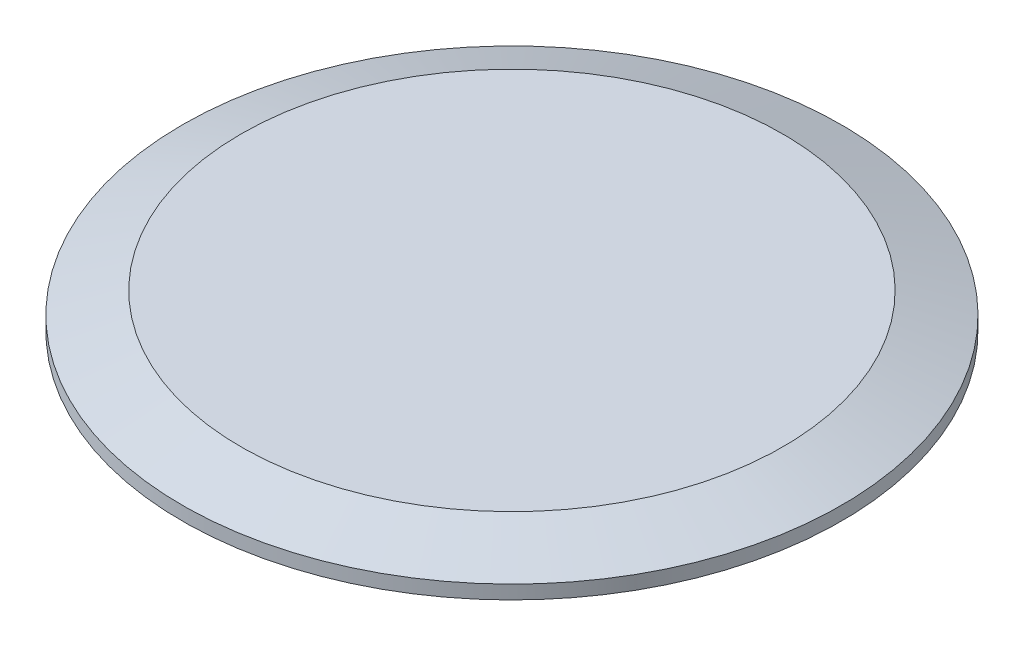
ISO-10303-21;
HEADER;
FILE_DESCRIPTION(('STEP AP214'),'2;1');
FILE_NAME('part.step','',(''),(''),'','','');
FILE_SCHEMA(('AUTOMOTIVE_DESIGN { 1 0 10303 214 1 1 1 1 }'));
ENDSEC;
DATA;
#1=APPLICATION_CONTEXT('core data for automotive mechanical design processes');
#2=APPLICATION_PROTOCOL_DEFINITION('international standard','automotive_design',2000,#1);
#3=PRODUCT_CONTEXT('',#1,'mechanical');
#4=PRODUCT('Part','Part','',(#3));
#5=PRODUCT_RELATED_PRODUCT_CATEGORY('part','',(#4));
#6=PRODUCT_DEFINITION_FORMATION('','',#4);
#7=PRODUCT_DEFINITION_CONTEXT('part definition',#1,'design');
#8=PRODUCT_DEFINITION('design','',#6,#7);
#9=PRODUCT_DEFINITION_SHAPE('','',#8);
#10=(LENGTH_UNIT() NAMED_UNIT(*) SI_UNIT(.MILLI.,.METRE.));
#11=(NAMED_UNIT(*) PLANE_ANGLE_UNIT() SI_UNIT($,.RADIAN.));
#12=(NAMED_UNIT(*) SI_UNIT($,.STERADIAN.) SOLID_ANGLE_UNIT());
#13=UNCERTAINTY_MEASURE_WITH_UNIT(LENGTH_MEASURE(1.E-05),#10,'distance_accuracy_value','');
#14=(GEOMETRIC_REPRESENTATION_CONTEXT(3) GLOBAL_UNCERTAINTY_ASSIGNED_CONTEXT((#13)) GLOBAL_UNIT_ASSIGNED_CONTEXT((#10,
#11,#12)) REPRESENTATION_CONTEXT('',''));
#15=CARTESIAN_POINT('',(0.,0.,0.));
#16=DIRECTION('',(0.,0.,1.));
#17=DIRECTION('',(1.,0.,0.));
#18=AXIS2_PLACEMENT_3D('',#15,#16,#17);
#19=CARTESIAN_POINT('',(-110.372213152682,14.2748,0.));
#20=DIRECTION('',(0.,1.,0.));
#21=DIRECTION('',(-1.,0.,0.));
#22=AXIS2_PLACEMENT_3D('',#19,#20,#21);
#23=PLANE('',#22);
#24=CARTESIAN_POINT('',(0.,14.2748,0.));
#25=DIRECTION('',(0.,1.,0.));
#26=DIRECTION('',(-1.,0.,0.));
#27=AXIS2_PLACEMENT_3D('',#24,#25,#26);
#28=CIRCLE('',#27,110.372213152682);
#29=CARTESIAN_POINT('',(-110.372213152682,14.2748,0.));
#30=VERTEX_POINT('',#29);
#31=EDGE_CURVE('E10',#30,#30,#28,.T.);
#32=ORIENTED_EDGE('',*,*,#31,.T.);
#33=EDGE_LOOP('',(#32));
#34=FACE_BOUND('',#33,.T.);
#35=ADVANCED_FACE('F31',(#34),#23,.T.);
#36=CARTESIAN_POINT('',(0.,14.2748,0.));
#37=DIRECTION('',(0.,-1.,0.));
#38=DIRECTION('',(1.,0.,0.));
#39=AXIS2_PLACEMENT_3D('',#36,#37,#38);
#40=CONICAL_SURFACE('',#39,110.372213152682,1.22173047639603);
#41=CARTESIAN_POINT('',(0.,5.588,0.));
#42=DIRECTION('',(0.,1.,0.));
#43=DIRECTION('',(-1.,0.,0.));
#44=AXIS2_PLACEMENT_3D('',#41,#42,#43);
#45=CIRCLE('',#44,134.239);
#46=CARTESIAN_POINT('',(-134.239,5.58799999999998,0.));
#47=VERTEX_POINT('',#46);
#48=EDGE_CURVE('E37',#47,#47,#45,.T.);
#49=ORIENTED_EDGE('',*,*,#48,.T.);
#50=EDGE_LOOP('',(#49));
#51=FACE_BOUND('',#50,.T.);
#52=ORIENTED_EDGE('',*,*,#31,.F.);
#53=EDGE_LOOP('',(#52));
#54=FACE_BOUND('',#53,.T.);
#55=ADVANCED_FACE('F72',(#51,#54),#40,.T.);
#56=CARTESIAN_POINT('',(0.,14.2748,0.));
#57=DIRECTION('',(0.,1.,0.));
#58=DIRECTION('',(-1.,0.,0.));
#59=AXIS2_PLACEMENT_3D('',#56,#57,#58);
#60=CYLINDRICAL_SURFACE('',#59,134.239);
#61=CARTESIAN_POINT('',(0.,0.,0.));
#62=DIRECTION('',(0.,1.,0.));
#63=DIRECTION('',(-1.,0.,0.));
#64=AXIS2_PLACEMENT_3D('',#61,#62,#63);
#65=CIRCLE('',#64,134.239);
#66=CARTESIAN_POINT('',(-134.239,0.,0.));
#67=VERTEX_POINT('',#66);
#68=EDGE_CURVE('E41',#67,#67,#65,.T.);
#69=ORIENTED_EDGE('',*,*,#68,.T.);
#70=EDGE_LOOP('',(#69));
#71=FACE_BOUND('',#70,.T.);
#72=ORIENTED_EDGE('',*,*,#48,.F.);
#73=EDGE_LOOP('',(#72));
#74=FACE_BOUND('',#73,.T.);
#75=ADVANCED_FACE('F76',(#71,#74),#60,.T.);
#76=CARTESIAN_POINT('',(-130.799208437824,0.,0.));
#77=DIRECTION('',(0.,-1.,0.));
#78=DIRECTION('',(1.,0.,0.));
#79=AXIS2_PLACEMENT_3D('',#76,#77,#78);
#80=PLANE('',#79);
#81=CARTESIAN_POINT('',(0.,0.,0.));
#82=DIRECTION('',(0.,1.,0.));
#83=DIRECTION('',(-1.,0.,0.));
#84=AXIS2_PLACEMENT_3D('',#81,#82,#83);
#85=CIRCLE('',#84,130.799208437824);
#86=CARTESIAN_POINT('',(-130.799208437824,0.,0.));
#87=VERTEX_POINT('',#86);
#88=EDGE_CURVE('E45',#87,#87,#85,.T.);
#89=ORIENTED_EDGE('',*,*,#88,.T.);
#90=EDGE_LOOP('',(#89));
#91=FACE_BOUND('',#90,.T.);
#92=ORIENTED_EDGE('',*,*,#68,.F.);
#93=EDGE_LOOP('',(#92));
#94=FACE_BOUND('',#93,.T.);
#95=ADVANCED_FACE('F80',(#91,#94),#80,.T.);
#96=CARTESIAN_POINT('',(0.,0.787400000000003,0.));
#97=DIRECTION('',(0.,1.,0.));
#98=DIRECTION('',(-1.,0.,0.));
#99=AXIS2_PLACEMENT_3D('',#96,#97,#98);
#100=TOROIDAL_SURFACE('',#99,130.799208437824,0.787400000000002);
#101=CARTESIAN_POINT('',(0.,0.474458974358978,0.));
#102=DIRECTION('',(0.,1.,0.));
#103=DIRECTION('',(-1.,0.,0.));
#104=AXIS2_PLACEMENT_3D('',#101,#102,#103);
#105=CIRCLE('',#104,130.076666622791);
#106=CARTESIAN_POINT('',(-130.076666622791,0.474458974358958,0.));
#107=VERTEX_POINT('',#106);
#108=EDGE_CURVE('E50',#107,#107,#105,.T.);
#109=ORIENTED_EDGE('',*,*,#108,.T.);
#110=EDGE_LOOP('',(#109));
#111=FACE_BOUND('',#110,.T.);
#112=ORIENTED_EDGE('',*,*,#88,.F.);
#113=EDGE_LOOP('',(#112));
#114=FACE_BOUND('',#113,.T.);
#115=ADVANCED_FACE('F87',(#111,#114),#100,.T.);
#116=CARTESIAN_POINT('',(0.,0.,0.));
#117=DIRECTION('',(0.,1.,0.));
#118=DIRECTION('',(-1.,0.,0.));
#119=AXIS2_PLACEMENT_3D('',#116,#117,#118);
#120=TOROIDAL_SURFACE('',#119,128.9812,1.1938);
#121=CARTESIAN_POINT('',(0.,0.474458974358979,0.));
#122=DIRECTION('',(0.,1.,0.));
#123=DIRECTION('',(-1.,0.,0.));
#124=AXIS2_PLACEMENT_3D('',#121,#122,#123);
#125=CIRCLE('',#124,127.885733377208);
#126=CARTESIAN_POINT('',(-127.885733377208,0.47445897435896,0.));
#127=VERTEX_POINT('',#126);
#128=EDGE_CURVE('E53',#127,#127,#125,.T.);
#129=ORIENTED_EDGE('',*,*,#128,.T.);
#130=EDGE_LOOP('',(#129));
#131=FACE_BOUND('',#130,.T.);
#132=ORIENTED_EDGE('',*,*,#108,.F.);
#133=EDGE_LOOP('',(#132));
#134=FACE_BOUND('',#133,.T.);
#135=ADVANCED_FACE('F69',(#131,#134),#120,.F.);
#136=CARTESIAN_POINT('',(0.,0.787400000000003,0.));
#137=DIRECTION('',(0.,1.,0.));
#138=DIRECTION('',(-1.,0.,0.));
#139=AXIS2_PLACEMENT_3D('',#136,#137,#138);
#140=TOROIDAL_SURFACE('',#139,127.163191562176,0.787400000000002);
#141=CARTESIAN_POINT('',(0.,0.,0.));
#142=DIRECTION('',(0.,1.,0.));
#143=DIRECTION('',(-1.,0.,0.));
#144=AXIS2_PLACEMENT_3D('',#141,#142,#143);
#145=CIRCLE('',#144,127.163191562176);
#146=CARTESIAN_POINT('',(-127.163191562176,0.,0.));
#147=VERTEX_POINT('',#146);
#148=EDGE_CURVE('E56',#147,#147,#145,.T.);
#149=ORIENTED_EDGE('',*,*,#148,.T.);
#150=EDGE_LOOP('',(#149));
#151=FACE_BOUND('',#150,.T.);
#152=ORIENTED_EDGE('',*,*,#128,.F.);
#153=EDGE_LOOP('',(#152));
#154=FACE_BOUND('',#153,.T.);
#155=ADVANCED_FACE('F60',(#151,#154),#140,.T.);
#156=CARTESIAN_POINT('',(0.,0.,0.));
#157=DIRECTION('',(0.,-1.,0.));
#158=DIRECTION('',(1.,0.,0.));
#159=AXIS2_PLACEMENT_3D('',#156,#157,#158);
#160=PLANE('',#159);
#161=ORIENTED_EDGE('',*,*,#148,.F.);
#162=EDGE_LOOP('',(#161));
#163=FACE_BOUND('',#162,.T.);
#164=ADVANCED_FACE('F63',(#163),#160,.T.);
#165=CLOSED_SHELL('',(#35,#55,#75,#95,#115,#135,#155,#164));
#166=MANIFOLD_SOLID_BREP('B2',#165);
#167=ADVANCED_BREP_SHAPE_REPRESENTATION('',(#18,#166),#14);
#168=SHAPE_DEFINITION_REPRESENTATION(#9,#167);
ENDSEC;
END-ISO-10303-21;
